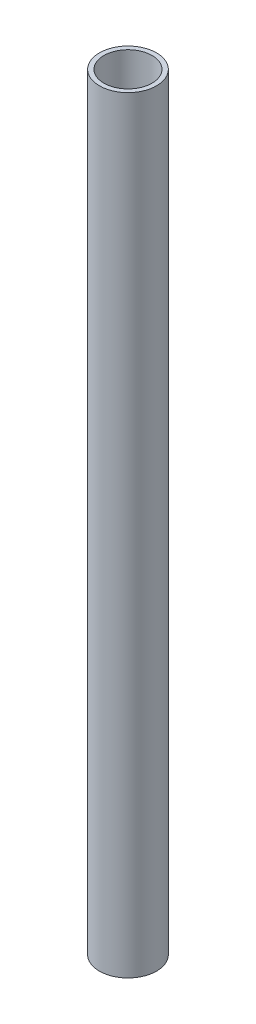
ISO-10303-21;
HEADER;
FILE_DESCRIPTION(('STEP AP214'),'2;1');
FILE_NAME('part.step','',(''),(''),'','','');
FILE_SCHEMA(('AUTOMOTIVE_DESIGN { 1 0 10303 214 1 1 1 1 }'));
ENDSEC;
DATA;
#1=APPLICATION_CONTEXT('core data for automotive mechanical design processes');
#2=APPLICATION_PROTOCOL_DEFINITION('international standard','automotive_design',2000,#1);
#3=PRODUCT_CONTEXT('',#1,'mechanical');
#4=PRODUCT('Part','Part','',(#3));
#5=PRODUCT_RELATED_PRODUCT_CATEGORY('part','',(#4));
#6=PRODUCT_DEFINITION_FORMATION('','',#4);
#7=PRODUCT_DEFINITION_CONTEXT('part definition',#1,'design');
#8=PRODUCT_DEFINITION('design','',#6,#7);
#9=PRODUCT_DEFINITION_SHAPE('','',#8);
#10=(LENGTH_UNIT() NAMED_UNIT(*) SI_UNIT(.MILLI.,.METRE.));
#11=(NAMED_UNIT(*) PLANE_ANGLE_UNIT() SI_UNIT($,.RADIAN.));
#12=(NAMED_UNIT(*) SI_UNIT($,.STERADIAN.) SOLID_ANGLE_UNIT());
#13=UNCERTAINTY_MEASURE_WITH_UNIT(LENGTH_MEASURE(1.E-05),#10,'distance_accuracy_value','');
#14=(GEOMETRIC_REPRESENTATION_CONTEXT(3) GLOBAL_UNCERTAINTY_ASSIGNED_CONTEXT((#13)) GLOBAL_UNIT_ASSIGNED_CONTEXT((#10,
#11,#12)) REPRESENTATION_CONTEXT('',''));
#15=CARTESIAN_POINT('',(0.,0.,0.));
#16=DIRECTION('',(0.,0.,1.));
#17=DIRECTION('',(1.,0.,0.));
#18=AXIS2_PLACEMENT_3D('',#15,#16,#17);
#19=CARTESIAN_POINT('',(0.,255.,0.));
#20=DIRECTION('',(0.,1.,0.));
#21=DIRECTION('',(0.,0.,1.));
#22=AXIS2_PLACEMENT_3D('',#19,#20,#21);
#23=PLANE('',#22);
#24=CARTESIAN_POINT('',(0.,255.,0.));
#25=DIRECTION('',(0.,1.,0.));
#26=DIRECTION('',(0.,0.,1.));
#27=AXIS2_PLACEMENT_3D('',#24,#25,#26);
#28=CIRCLE('',#27,19.);
#29=CARTESIAN_POINT('',(0.,255.,19.));
#30=VERTEX_POINT('',#29);
#31=EDGE_CURVE('E11',#30,#30,#28,.T.);
#32=ORIENTED_EDGE('',*,*,#31,.T.);
#33=EDGE_LOOP('',(#32));
#34=FACE_BOUND('',#33,.T.);
#35=CARTESIAN_POINT('',(0.,255.,0.));
#36=DIRECTION('',(0.,1.,0.));
#37=DIRECTION('',(1.,0.,0.));
#38=AXIS2_PLACEMENT_3D('',#35,#36,#37);
#39=CIRCLE('',#38,16.);
#40=CARTESIAN_POINT('',(16.,255.,0.));
#41=VERTEX_POINT('',#40);
#42=EDGE_CURVE('E53',#41,#41,#39,.T.);
#43=ORIENTED_EDGE('',*,*,#42,.F.);
#44=EDGE_LOOP('',(#43));
#45=FACE_BOUND('',#44,.T.);
#46=ADVANCED_FACE('F42',(#34,#45),#23,.T.);
#47=CARTESIAN_POINT('',(0.,-255.,0.));
#48=DIRECTION('',(0.,1.,0.));
#49=DIRECTION('',(0.,0.,1.));
#50=AXIS2_PLACEMENT_3D('',#47,#48,#49);
#51=PLANE('',#50);
#52=CARTESIAN_POINT('',(0.,-255.,0.));
#53=DIRECTION('',(0.,1.,0.));
#54=DIRECTION('',(0.,0.,1.));
#55=AXIS2_PLACEMENT_3D('',#52,#53,#54);
#56=CIRCLE('',#55,19.);
#57=CARTESIAN_POINT('',(0.,-255.,19.));
#58=VERTEX_POINT('',#57);
#59=EDGE_CURVE('E46',#58,#58,#56,.T.);
#60=ORIENTED_EDGE('',*,*,#59,.F.);
#61=EDGE_LOOP('',(#60));
#62=FACE_BOUND('',#61,.T.);
#63=CARTESIAN_POINT('',(0.,-255.,0.));
#64=DIRECTION('',(0.,1.,0.));
#65=DIRECTION('',(1.,0.,0.));
#66=AXIS2_PLACEMENT_3D('',#63,#64,#65);
#67=CIRCLE('',#66,16.);
#68=CARTESIAN_POINT('',(16.,-255.,0.));
#69=VERTEX_POINT('',#68);
#70=EDGE_CURVE('E55',#69,#69,#67,.T.);
#71=ORIENTED_EDGE('',*,*,#70,.T.);
#72=EDGE_LOOP('',(#71));
#73=FACE_BOUND('',#72,.T.);
#74=ADVANCED_FACE('F65',(#62,#73),#51,.F.);
#75=CARTESIAN_POINT('',(0.,255.,0.));
#76=DIRECTION('',(0.,-1.,0.));
#77=DIRECTION('',(0.,0.,-1.));
#78=AXIS2_PLACEMENT_3D('',#75,#76,#77);
#79=CYLINDRICAL_SURFACE('',#78,19.);
#80=ORIENTED_EDGE('',*,*,#31,.F.);
#81=EDGE_LOOP('',(#80));
#82=FACE_BOUND('',#81,.T.);
#83=ORIENTED_EDGE('',*,*,#59,.T.);
#84=EDGE_LOOP('',(#83));
#85=FACE_BOUND('',#84,.T.);
#86=ADVANCED_FACE('F44',(#82,#85),#79,.T.);
#87=CARTESIAN_POINT('',(0.,255.,0.));
#88=DIRECTION('',(0.,-1.,0.));
#89=DIRECTION('',(0.,0.,-1.));
#90=AXIS2_PLACEMENT_3D('',#87,#88,#89);
#91=CYLINDRICAL_SURFACE('',#90,16.);
#92=ORIENTED_EDGE('',*,*,#42,.T.);
#93=EDGE_LOOP('',(#92));
#94=FACE_BOUND('',#93,.T.);
#95=ORIENTED_EDGE('',*,*,#70,.F.);
#96=EDGE_LOOP('',(#95));
#97=FACE_BOUND('',#96,.T.);
#98=ADVANCED_FACE('F61',(#94,#97),#91,.F.);
#99=CLOSED_SHELL('',(#46,#74,#86,#98));
#100=MANIFOLD_SOLID_BREP('B2',#99);
#101=ADVANCED_BREP_SHAPE_REPRESENTATION('',(#18,#100),#14);
#102=SHAPE_DEFINITION_REPRESENTATION(#9,#101);
ENDSEC;
END-ISO-10303-21;
